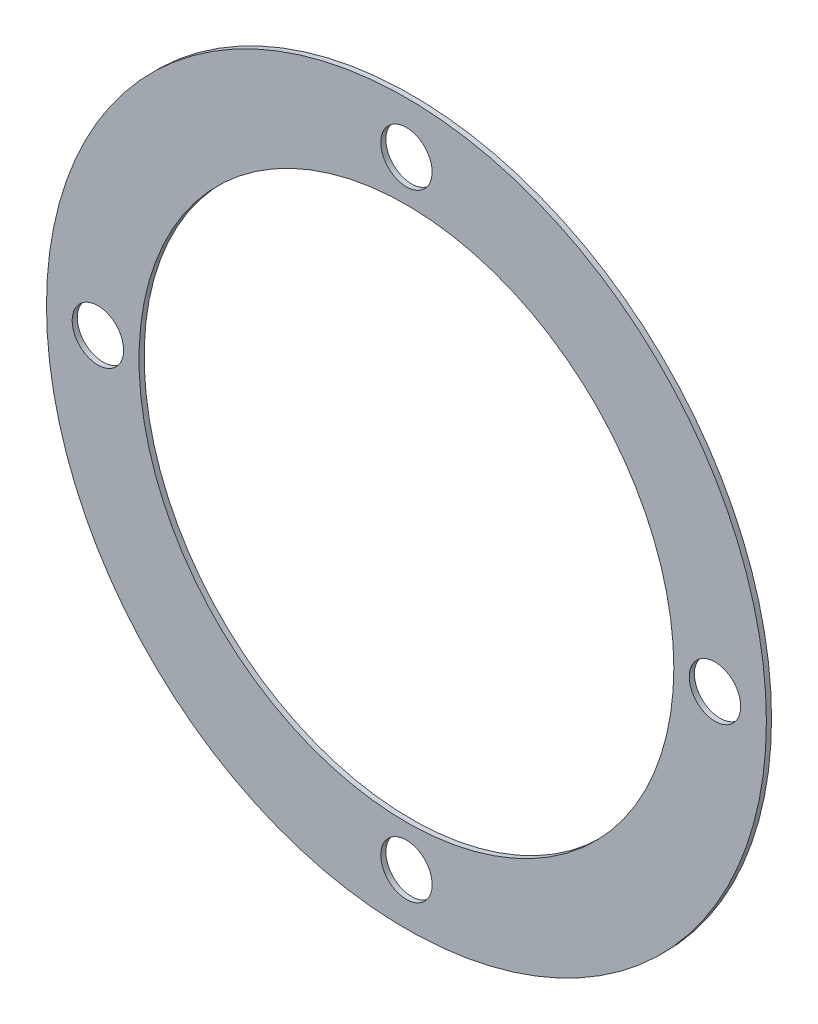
from build123d import *

# Parameters (mm, degrees)
ESQUISSE1_R                  = 35
ESQUISSE1_R_2                = 26
BASE_EXTRUSION_DEPTH         = 0.5
ESQUISSE2_R                  = 2.5
ENL_V_MAT_EXTRU_1_DEPTH      = 50.5
R_P_TITION_CIRCULAIRE1_COUNT = 4


with BuildPart() as part:
    # Esquisse1 → Base-Extrusion (new body)
    with BuildSketch(Plane.XY):
        Circle(ESQUISSE1_R)
        Circle(ESQUISSE1_R_2, mode=Mode.SUBTRACT)
    extrude(amount=BASE_EXTRUSION_DEPTH)

    # Esquisse2 → Enl_v. mat.-Extru.1 (cut, through all)
    with BuildSketch(Plane.XY.offset(0.5)):
        with Locations((0, 30)):
            Circle(ESQUISSE2_R)
    enl_v_mat_extru_1 = extrude(amount=-ENL_V_MAT_EXTRU_1_DEPTH, mode=Mode.SUBTRACT)

    # R_p_tition circulaire1: Enl_v. mat.-Extru.1 ×4 about axis
    r_p_tition_circulaire1_axis = Axis((0, 0, 0), (0, 0, -1))
    for i in range(1, R_P_TITION_CIRCULAIRE1_COUNT):
        add(enl_v_mat_extru_1.rotate(r_p_tition_circulaire1_axis, i * 360 / R_P_TITION_CIRCULAIRE1_COUNT), mode=Mode.SUBTRACT)


solid = part.part
